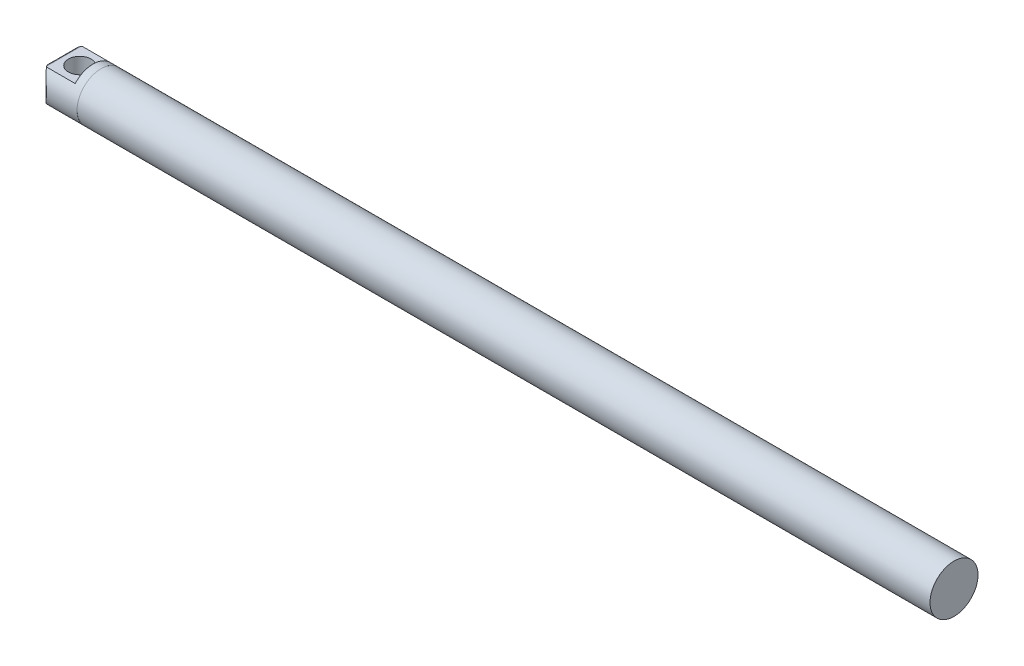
ISO-10303-21;
HEADER;
FILE_DESCRIPTION(('STEP AP214'),'2;1');
FILE_NAME('part.step','',(''),(''),'','','');
FILE_SCHEMA(('AUTOMOTIVE_DESIGN { 1 0 10303 214 1 1 1 1 }'));
ENDSEC;
DATA;
#1=APPLICATION_CONTEXT('core data for automotive mechanical design processes');
#2=APPLICATION_PROTOCOL_DEFINITION('international standard','automotive_design',2000,#1);
#3=PRODUCT_CONTEXT('',#1,'mechanical');
#4=PRODUCT('Part','Part','',(#3));
#5=PRODUCT_RELATED_PRODUCT_CATEGORY('part','',(#4));
#6=PRODUCT_DEFINITION_FORMATION('','',#4);
#7=PRODUCT_DEFINITION_CONTEXT('part definition',#1,'design');
#8=PRODUCT_DEFINITION('design','',#6,#7);
#9=PRODUCT_DEFINITION_SHAPE('','',#8);
#10=(LENGTH_UNIT() NAMED_UNIT(*) SI_UNIT(.MILLI.,.METRE.));
#11=(NAMED_UNIT(*) PLANE_ANGLE_UNIT() SI_UNIT($,.RADIAN.));
#12=(NAMED_UNIT(*) SI_UNIT($,.STERADIAN.) SOLID_ANGLE_UNIT());
#13=UNCERTAINTY_MEASURE_WITH_UNIT(LENGTH_MEASURE(1.E-05),#10,'distance_accuracy_value','');
#14=(GEOMETRIC_REPRESENTATION_CONTEXT(3) GLOBAL_UNCERTAINTY_ASSIGNED_CONTEXT((#13)) GLOBAL_UNIT_ASSIGNED_CONTEXT((#10,
#11,#12)) REPRESENTATION_CONTEXT('',''));
#15=CARTESIAN_POINT('',(0.,0.,0.));
#16=DIRECTION('',(0.,0.,1.));
#17=DIRECTION('',(1.,0.,0.));
#18=AXIS2_PLACEMENT_3D('',#15,#16,#17);
#19=CARTESIAN_POINT('',(6.87386354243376,-3.,0.));
#20=DIRECTION('',(0.,-1.,0.));
#21=DIRECTION('',(0.,0.,-1.));
#22=AXIS2_PLACEMENT_3D('',#19,#20,#21);
#23=PLANE('',#22);
#24=CARTESIAN_POINT('',(-4.,-3.,0.));
#25=DIRECTION('',(0.,-1.,0.));
#26=DIRECTION('',(0.,0.,-1.));
#27=AXIS2_PLACEMENT_3D('',#24,#25,#26);
#28=CIRCLE('',#27,2.125);
#29=CARTESIAN_POINT('',(-4.,-3.,-2.125));
#30=VERTEX_POINT('',#29);
#31=EDGE_CURVE('E137',#30,#30,#28,.T.);
#32=ORIENTED_EDGE('',*,*,#31,.F.);
#33=EDGE_LOOP('',(#32));
#34=FACE_BOUND('',#33,.T.);
#35=CARTESIAN_POINT('',(-2.375,-3.,0.));
#36=DIRECTION('',(0.,-1.,0.));
#37=DIRECTION('',(0.,0.,-1.));
#38=AXIS2_PLACEMENT_3D('',#35,#36,#37);
#39=CIRCLE('',#38,5.625);
#40=CARTESIAN_POINT('',(-7.,-3.,3.20156211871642));
#41=VERTEX_POINT('',#40);
#42=CARTESIAN_POINT('',(-6.89059796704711,-3.,3.35410196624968));
#43=VERTEX_POINT('',#42);
#44=EDGE_CURVE('E340',#41,#43,#39,.F.);
#45=ORIENTED_EDGE('',*,*,#44,.F.);
#46=CARTESIAN_POINT('',(-7.,-3.,-4.95));
#47=CARTESIAN_POINT('',(-7.,-3.,-1.65));
#48=CARTESIAN_POINT('',(-7.,-3.,1.65));
#49=CARTESIAN_POINT('',(-7.,-3.,4.95));
#50=(BOUNDED_CURVE() B_SPLINE_CURVE(3,(#46,#47,#48,#49),.UNSPECIFIED.,.F.,
.F.) B_SPLINE_CURVE_WITH_KNOTS((4,4),(-0.00495,0.00495),
.UNSPECIFIED.) CURVE() GEOMETRIC_REPRESENTATION_ITEM() RATIONAL_B_SPLINE_CURVE((1.,1.,1.,1.)) REPRESENTATION_ITEM(''));
#51=CARTESIAN_POINT('',(-7.,-3.,-3.20156211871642));
#52=VERTEX_POINT('',#51);
#53=EDGE_CURVE('E134',#41,#52,#50,.F.);
#54=ORIENTED_EDGE('',*,*,#53,.T.);
#55=CARTESIAN_POINT('',(-2.375,-3.,0.));
#56=DIRECTION('',(0.,-1.,0.));
#57=DIRECTION('',(0.,0.,-1.));
#58=AXIS2_PLACEMENT_3D('',#55,#56,#57);
#59=CIRCLE('',#58,5.625);
#60=CARTESIAN_POINT('',(-6.89059796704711,-3.,-3.35410196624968));
#61=VERTEX_POINT('',#60);
#62=EDGE_CURVE('E114',#61,#52,#59,.F.);
#63=ORIENTED_EDGE('',*,*,#62,.F.);
#64=DIRECTION('',(-1.,0.,0.));
#65=VECTOR('',#64,1.);
#66=CARTESIAN_POINT('',(6.87386354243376,-3.,-3.35410196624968));
#67=LINE('',#66,#65);
#68=CARTESIAN_POINT('',(-1.5,-3.,-3.35410196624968));
#69=VERTEX_POINT('',#68);
#70=EDGE_CURVE('E110',#69,#61,#67,.T.);
#71=ORIENTED_EDGE('',*,*,#70,.F.);
#72=DIRECTION('',(0.,0.,-1.));
#73=VECTOR('',#72,1.);
#74=CARTESIAN_POINT('',(-1.5,-3.,0.));
#75=LINE('',#74,#73);
#76=CARTESIAN_POINT('',(-1.5,-3.,3.35410196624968));
#77=VERTEX_POINT('',#76);
#78=EDGE_CURVE('E98',#77,#69,#75,.T.);
#79=ORIENTED_EDGE('',*,*,#78,.F.);
#80=DIRECTION('',(-1.,0.,0.));
#81=VECTOR('',#80,1.);
#82=CARTESIAN_POINT('',(6.87386354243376,-3.,3.35410196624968));
#83=LINE('',#82,#81);
#84=EDGE_CURVE('E106',#77,#43,#83,.T.);
#85=ORIENTED_EDGE('',*,*,#84,.T.);
#86=EDGE_LOOP('',(#45,#54,#63,#71,#79,#85));
#87=FACE_BOUND('',#86,.T.);
#88=ADVANCED_FACE('F56',(#34,#87),#23,.T.);
#89=CARTESIAN_POINT('',(6.87386354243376,3.,0.));
#90=DIRECTION('',(0.,-1.,0.));
#91=DIRECTION('',(0.,0.,-1.));
#92=AXIS2_PLACEMENT_3D('',#89,#90,#91);
#93=PLANE('',#92);
#94=CARTESIAN_POINT('',(-4.,3.,0.));
#95=DIRECTION('',(0.,-1.,0.));
#96=DIRECTION('',(0.,0.,-1.));
#97=AXIS2_PLACEMENT_3D('',#94,#95,#96);
#98=CIRCLE('',#97,2.125);
#99=CARTESIAN_POINT('',(-4.,3.,-2.125));
#100=VERTEX_POINT('',#99);
#101=EDGE_CURVE('E117',#100,#100,#98,.T.);
#102=ORIENTED_EDGE('',*,*,#101,.T.);
#103=EDGE_LOOP('',(#102));
#104=FACE_BOUND('',#103,.T.);
#105=CARTESIAN_POINT('',(-7.,3.,4.95));
#106=CARTESIAN_POINT('',(-7.,3.,1.65));
#107=CARTESIAN_POINT('',(-7.,3.,-1.65));
#108=CARTESIAN_POINT('',(-7.,3.,-4.95));
#109=(BOUNDED_CURVE() B_SPLINE_CURVE(3,(#105,#106,#107,#108),.UNSPECIFIED.,.F.,
.F.) B_SPLINE_CURVE_WITH_KNOTS((4,4),(-0.00495,0.00495),
.UNSPECIFIED.) CURVE() GEOMETRIC_REPRESENTATION_ITEM() RATIONAL_B_SPLINE_CURVE((1.,1.,1.,1.)) REPRESENTATION_ITEM(''));
#110=CARTESIAN_POINT('',(-7.,3.,-3.20156211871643));
#111=VERTEX_POINT('',#110);
#112=CARTESIAN_POINT('',(-7.,3.,3.20156211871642));
#113=VERTEX_POINT('',#112);
#114=EDGE_CURVE('E309',#111,#113,#109,.F.);
#115=ORIENTED_EDGE('',*,*,#114,.T.);
#116=CARTESIAN_POINT('',(-2.375,3.,0.));
#117=DIRECTION('',(0.,-1.,0.));
#118=DIRECTION('',(0.,0.,-1.));
#119=AXIS2_PLACEMENT_3D('',#116,#117,#118);
#120=CIRCLE('',#119,5.625);
#121=CARTESIAN_POINT('',(-6.89059796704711,3.,3.35410196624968));
#122=VERTEX_POINT('',#121);
#123=EDGE_CURVE('E77',#113,#122,#120,.F.);
#124=ORIENTED_EDGE('',*,*,#123,.T.);
#125=DIRECTION('',(-1.,0.,0.));
#126=VECTOR('',#125,1.);
#127=CARTESIAN_POINT('',(6.87386354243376,3.,3.35410196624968));
#128=LINE('',#127,#126);
#129=CARTESIAN_POINT('',(-1.5,3.,3.35410196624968));
#130=VERTEX_POINT('',#129);
#131=EDGE_CURVE('E125',#130,#122,#128,.T.);
#132=ORIENTED_EDGE('',*,*,#131,.F.);
#133=DIRECTION('',(0.,0.,-1.));
#134=VECTOR('',#133,1.);
#135=CARTESIAN_POINT('',(-1.5,3.,0.));
#136=LINE('',#135,#134);
#137=CARTESIAN_POINT('',(-1.5,3.,-3.35410196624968));
#138=VERTEX_POINT('',#137);
#139=EDGE_CURVE('E86',#130,#138,#136,.T.);
#140=ORIENTED_EDGE('',*,*,#139,.T.);
#141=DIRECTION('',(-1.,0.,0.));
#142=VECTOR('',#141,1.);
#143=CARTESIAN_POINT('',(6.87386354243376,3.,-3.35410196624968));
#144=LINE('',#143,#142);
#145=CARTESIAN_POINT('',(-6.89059796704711,3.,-3.35410196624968));
#146=VERTEX_POINT('',#145);
#147=EDGE_CURVE('E123',#138,#146,#144,.T.);
#148=ORIENTED_EDGE('',*,*,#147,.T.);
#149=CARTESIAN_POINT('',(-2.375,3.,0.));
#150=DIRECTION('',(0.,-1.,0.));
#151=DIRECTION('',(0.,0.,-1.));
#152=AXIS2_PLACEMENT_3D('',#149,#150,#151);
#153=CIRCLE('',#152,5.625);
#154=EDGE_CURVE('E278',#146,#111,#153,.F.);
#155=ORIENTED_EDGE('',*,*,#154,.T.);
#156=EDGE_LOOP('',(#115,#124,#132,#140,#148,#155));
#157=FACE_BOUND('',#156,.T.);
#158=ADVANCED_FACE('F158',(#104,#157),#93,.F.);
#159=CARTESIAN_POINT('',(-8.,0.,0.));
#160=DIRECTION('',(1.,0.,0.));
#161=DIRECTION('',(0.,0.,-1.));
#162=AXIS2_PLACEMENT_3D('',#159,#160,#161);
#163=CYLINDRICAL_SURFACE('',#162,4.5);
#164=ORIENTED_EDGE('',*,*,#131,.T.);
#165=CARTESIAN_POINT('',(-8.,4.5,0.));
#166=CARTESIAN_POINT('',(-8.0000261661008,4.50002487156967,0.108672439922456));
#167=CARTESIAN_POINT('',(-7.99685185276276,4.4960645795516,0.217328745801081));
#168=CARTESIAN_POINT('',(-7.98429829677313,4.48036197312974,0.43364470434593));
#169=CARTESIAN_POINT('',(-7.97492328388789,4.4686249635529,0.541304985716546));
#170=CARTESIAN_POINT('',(-7.95025630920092,4.43767275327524,0.754017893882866));
#171=CARTESIAN_POINT('',(-7.93500905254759,4.41851404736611,0.859083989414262));
#172=CARTESIAN_POINT('',(-7.8989397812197,4.37303995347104,1.0666829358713));
#173=CARTESIAN_POINT('',(-7.8781170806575,4.34672368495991,1.16921547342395));
#174=CARTESIAN_POINT('',(-7.83138654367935,4.28740740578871,1.37082003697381));
#175=CARTESIAN_POINT('',(-7.80549255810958,4.25442559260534,1.46990064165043));
#176=CARTESIAN_POINT('',(-7.74907704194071,4.18217468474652,1.66438967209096));
#177=CARTESIAN_POINT('',(-7.71855384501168,4.14290332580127,1.75979675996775));
#178=CARTESIAN_POINT('',(-7.62071427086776,4.01619280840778,2.04015550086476));
#179=CARTESIAN_POINT('',(-7.54717032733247,3.91991033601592,2.21906761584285));
#180=CARTESIAN_POINT('',(-7.41400776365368,3.74208663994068,2.50300782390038));
#181=CARTESIAN_POINT('',(-7.35765928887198,3.66596359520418,2.61311577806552));
#182=CARTESIAN_POINT('',(-7.24077925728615,3.50545479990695,2.82478438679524));
#183=CARTESIAN_POINT('',(-7.18024773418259,3.42106911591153,2.92634511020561));
#184=CARTESIAN_POINT('',(-7.05616873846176,3.24448393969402,3.12100163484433));
#185=CARTESIAN_POINT('',(-6.99261353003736,3.15226387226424,3.21407372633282));
#186=CARTESIAN_POINT('',(-6.86402643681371,2.9607052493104,3.39134893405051));
#187=CARTESIAN_POINT('',(-6.79899514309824,2.86136950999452,3.47555552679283));
#188=CARTESIAN_POINT('',(-6.66786388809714,2.65416610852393,3.63632686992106));
#189=CARTESIAN_POINT('',(-6.60176339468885,2.54618779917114,3.712748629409));
#190=CARTESIAN_POINT('',(-6.47126926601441,2.32314199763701,3.8562425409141));
#191=CARTESIAN_POINT('',(-6.4068761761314,2.2080722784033,3.92331173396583));
#192=CARTESIAN_POINT('',(-6.28212790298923,1.97107666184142,4.04755486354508));
#193=CARTESIAN_POINT('',(-6.22176202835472,1.84917063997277,4.10475569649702));
#194=CARTESIAN_POINT('',(-6.1076087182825,1.59819949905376,4.20882590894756));
#195=CARTESIAN_POINT('',(-6.0538156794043,1.46914061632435,4.25570411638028));
#196=CARTESIAN_POINT('',(-5.94878886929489,1.1837991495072,4.34443093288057));
#197=CARTESIAN_POINT('',(-5.89913843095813,1.02633016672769,4.3844814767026));
#198=CARTESIAN_POINT('',(-5.83904774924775,0.784290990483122,4.43188997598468));
#199=CARTESIAN_POINT('',(-5.82142186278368,0.702693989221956,4.44557676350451));
#200=CARTESIAN_POINT('',(-5.79163831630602,0.537908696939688,4.46850787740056));
#201=CARTESIAN_POINT('',(-5.77947792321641,0.454721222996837,4.47775442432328));
#202=CARTESIAN_POINT('',(-5.76109976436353,0.286524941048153,4.49166889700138));
#203=CARTESIAN_POINT('',(-5.75493766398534,0.201506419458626,4.49629394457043));
#204=CARTESIAN_POINT('',(-5.74906972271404,0.0311215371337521,4.50069912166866));
#205=CARTESIAN_POINT('',(-5.74936356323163,-0.0542448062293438,4.50047949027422));
#206=CARTESIAN_POINT('',(-5.75639368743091,-0.224602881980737,4.49519969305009));
#207=CARTESIAN_POINT('',(-5.76313338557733,-0.309594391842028,4.49013696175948));
#208=CARTESIAN_POINT('',(-5.78271599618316,-0.478484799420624,4.47529282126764));
#209=CARTESIAN_POINT('',(-5.79556215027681,-0.562383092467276,4.4655089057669));
#210=CARTESIAN_POINT('',(-5.82919455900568,-0.741434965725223,4.43955869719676));
#211=CARTESIAN_POINT('',(-5.85090630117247,-0.836304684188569,4.42263531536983));
#212=CARTESIAN_POINT('',(-5.90054851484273,-1.02323008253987,4.38316564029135));
#213=CARTESIAN_POINT('',(-5.92848362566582,-1.1152836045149,4.36061515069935));
#214=CARTESIAN_POINT('',(-6.01991290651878,-1.38707045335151,4.28502580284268));
#215=CARTESIAN_POINT('',(-6.09096633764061,-1.56212336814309,4.22409562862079));
#216=CARTESIAN_POINT('',(-6.22506502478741,-1.85603168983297,4.10166808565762));
#217=CARTESIAN_POINT('',(-6.28555954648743,-1.97786670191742,4.04424657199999));
#218=CARTESIAN_POINT('',(-6.41040539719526,-2.21449049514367,3.91968092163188));
#219=CARTESIAN_POINT('',(-6.4747585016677,-2.32927598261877,3.85253228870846));
#220=CARTESIAN_POINT('',(-6.60522718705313,-2.55192894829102,3.70880611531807));
#221=CARTESIAN_POINT('',(-6.67134479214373,-2.65978795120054,3.63221734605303));
#222=CARTESIAN_POINT('',(-6.80350788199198,-2.86837215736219,3.46985600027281));
#223=CARTESIAN_POINT('',(-6.86955337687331,-2.96909853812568,3.38408494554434));
#224=CARTESIAN_POINT('',(-7.00179089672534,-3.1657547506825,3.20101850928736));
#225=CARTESIAN_POINT('',(-7.06793973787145,-3.26148466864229,3.10347654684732));
#226=CARTESIAN_POINT('',(-7.19701960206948,-3.44462830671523,2.89886039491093));
#227=CARTESIAN_POINT('',(-7.25995013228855,-3.53204075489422,2.79178475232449));
#228=CARTESIAN_POINT('',(-7.38094837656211,-3.69757703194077,2.56849759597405));
#229=CARTESIAN_POINT('',(-7.43902625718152,-3.77572043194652,2.45230622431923));
#230=CARTESIAN_POINT('',(-7.54892283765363,-3.92188319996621,2.21105075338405));
#231=CARTESIAN_POINT('',(-7.60074450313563,-3.98990736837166,2.08599090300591));
#232=CARTESIAN_POINT('',(-7.71705925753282,-4.14128430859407,1.7724231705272));
#233=CARTESIAN_POINT('',(-7.77759057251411,-4.21888269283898,1.57952084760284));
#234=CARTESIAN_POINT('',(-7.85332276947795,-4.31529563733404,1.28032523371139));
#235=CARTESIAN_POINT('',(-7.87604793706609,-4.34409248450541,1.17900959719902));
#236=CARTESIAN_POINT('',(-7.91608660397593,-4.39468518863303,0.973608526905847));
#237=CARTESIAN_POINT('',(-7.93340176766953,-4.41648319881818,0.869523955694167));
#238=CARTESIAN_POINT('',(-7.96501040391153,-4.45620518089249,0.639056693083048));
#239=CARTESIAN_POINT('',(-7.97808537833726,-4.47258174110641,0.512229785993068));
#240=CARTESIAN_POINT('',(-7.99120914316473,-4.48900761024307,0.320825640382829));
#241=CARTESIAN_POINT('',(-7.99450231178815,-4.49312643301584,0.256780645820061));
#242=CARTESIAN_POINT('',(-7.99889853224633,-4.49862325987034,0.128495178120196));
#243=CARTESIAN_POINT('',(-8.00000147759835,-4.50000113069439,0.0642546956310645));
#244=CARTESIAN_POINT('',(-8.,-4.5,0.));
#245=B_SPLINE_CURVE_WITH_KNOTS('',3,(#165,#166,#167,#168,#169,#170,#171,#172,#173,#174,#175,
#176,#177,#178,#179,#180,#181,#182,#183,#184,#185,#186,#187,#188,#189,#190,#191,#192,#193,#194,
#195,#196,#197,#198,#199,#200,#201,#202,#203,#204,#205,#206,#207,#208,#209,#210,#211,#212,#213,
#214,#215,#216,#217,#218,#219,#220,#221,#222,#223,#224,#225,#226,#227,#228,#229,#230,#231,#232,
#233,#234,#235,#236,#237,#238,#239,#240,#241,#242,#243,#244),.UNSPECIFIED.,.F.,.F.,(4,2,2,2,2,2,
2,2,2,2,2,2,2,2,2,2,2,2,2,2,2,2,2,2,2,2,2,2,2,2,2,2,2,2,2,2,2,2,2,4),(0.,0.325873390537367,
0.651524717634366,0.974744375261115,1.2980038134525,1.6203923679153,1.94289724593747,
2.58846980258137,3.02370253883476,3.45893176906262,3.89534162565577,4.33157970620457,
4.77476231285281,5.21808481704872,5.66017926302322,6.10189414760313,6.60960830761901,
6.86313355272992,7.11653187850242,7.37225998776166,7.62797547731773,7.88382649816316,
8.13981349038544,8.4356990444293,8.73180591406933,9.32495860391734,9.7674351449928,
10.2101168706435,10.6533303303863,11.0964704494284,11.5514441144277,12.0064872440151,
12.4605517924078,12.9144002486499,13.560943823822,13.8838717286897,14.2067001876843,
14.5915126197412,14.7842151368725,14.97692702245),.UNSPECIFIED.);
#246=EDGE_CURVE('E339',#122,#43,#245,.T.);
#247=ORIENTED_EDGE('',*,*,#246,.T.);
#248=ORIENTED_EDGE('',*,*,#84,.F.);
#249=CARTESIAN_POINT('',(-1.5,0.,0.));
#250=DIRECTION('',(-1.,0.,0.));
#251=DIRECTION('',(0.,0.,1.));
#252=AXIS2_PLACEMENT_3D('',#249,#250,#251);
#253=CIRCLE('',#252,4.5);
#254=EDGE_CURVE('E102',#77,#69,#253,.F.);
#255=ORIENTED_EDGE('',*,*,#254,.T.);
#256=ORIENTED_EDGE('',*,*,#70,.T.);
#257=CARTESIAN_POINT('',(-8.,-4.5,0.));
#258=CARTESIAN_POINT('',(-8.0000261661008,-4.50002487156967,-0.108672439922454));
#259=CARTESIAN_POINT('',(-7.99685185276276,-4.4960645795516,-0.217328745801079));
#260=CARTESIAN_POINT('',(-7.98429829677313,-4.48036197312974,-0.433644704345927));
#261=CARTESIAN_POINT('',(-7.97492328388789,-4.4686249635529,-0.541304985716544));
#262=CARTESIAN_POINT('',(-7.95025630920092,-4.43767275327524,-0.754017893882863));
#263=CARTESIAN_POINT('',(-7.93500905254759,-4.41851404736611,-0.859083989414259));
#264=CARTESIAN_POINT('',(-7.8989397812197,-4.37303995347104,-1.06668293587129));
#265=CARTESIAN_POINT('',(-7.8781170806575,-4.34672368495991,-1.16921547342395));
#266=CARTESIAN_POINT('',(-7.83138654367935,-4.28740740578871,-1.3708200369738));
#267=CARTESIAN_POINT('',(-7.80549255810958,-4.25442559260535,-1.46990064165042));
#268=CARTESIAN_POINT('',(-7.74907704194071,-4.18217468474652,-1.66438967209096));
#269=CARTESIAN_POINT('',(-7.71855384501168,-4.14290332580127,-1.75979675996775));
#270=CARTESIAN_POINT('',(-7.62071427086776,-4.01619280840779,-2.04015550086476));
#271=CARTESIAN_POINT('',(-7.54717032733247,-3.91991033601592,-2.21906761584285));
#272=CARTESIAN_POINT('',(-7.41400776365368,-3.74208663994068,-2.50300782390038));
#273=CARTESIAN_POINT('',(-7.35765928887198,-3.66596359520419,-2.61311577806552));
#274=CARTESIAN_POINT('',(-7.24077925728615,-3.50545479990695,-2.82478438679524));
#275=CARTESIAN_POINT('',(-7.18024773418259,-3.42106911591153,-2.92634511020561));
#276=CARTESIAN_POINT('',(-7.05616873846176,-3.24448393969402,-3.12100163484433));
#277=CARTESIAN_POINT('',(-6.99261353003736,-3.15226387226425,-3.21407372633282));
#278=CARTESIAN_POINT('',(-6.86402643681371,-2.9607052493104,-3.3913489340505));
#279=CARTESIAN_POINT('',(-6.79899514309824,-2.86136950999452,-3.47555552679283));
#280=CARTESIAN_POINT('',(-6.66786388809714,-2.65416610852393,-3.63632686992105));
#281=CARTESIAN_POINT('',(-6.60176339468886,-2.54618779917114,-3.712748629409));
#282=CARTESIAN_POINT('',(-6.47126926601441,-2.32314199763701,-3.8562425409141));
#283=CARTESIAN_POINT('',(-6.4068761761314,-2.2080722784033,-3.92331173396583));
#284=CARTESIAN_POINT('',(-6.28212790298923,-1.97107666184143,-4.04755486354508));
#285=CARTESIAN_POINT('',(-6.22176202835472,-1.84917063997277,-4.10475569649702));
#286=CARTESIAN_POINT('',(-6.1076087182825,-1.59819949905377,-4.20882590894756));
#287=CARTESIAN_POINT('',(-6.05381567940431,-1.46914061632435,-4.25570411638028));
#288=CARTESIAN_POINT('',(-5.94878886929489,-1.1837991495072,-4.34443093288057));
#289=CARTESIAN_POINT('',(-5.89913843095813,-1.02633016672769,-4.3844814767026));
#290=CARTESIAN_POINT('',(-5.83904774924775,-0.784290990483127,-4.43188997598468));
#291=CARTESIAN_POINT('',(-5.82142186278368,-0.70269398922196,-4.44557676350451));
#292=CARTESIAN_POINT('',(-5.79163831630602,-0.537908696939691,-4.46850787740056));
#293=CARTESIAN_POINT('',(-5.77947792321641,-0.45472122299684,-4.47775442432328));
#294=CARTESIAN_POINT('',(-5.76109976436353,-0.286524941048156,-4.49166889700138));
#295=CARTESIAN_POINT('',(-5.75493766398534,-0.201506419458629,-4.49629394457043));
#296=CARTESIAN_POINT('',(-5.74906972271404,-0.0311215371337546,-4.50069912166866));
#297=CARTESIAN_POINT('',(-5.74936356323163,0.0542448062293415,-4.50047949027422));
#298=CARTESIAN_POINT('',(-5.75639368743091,0.224602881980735,-4.49519969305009));
#299=CARTESIAN_POINT('',(-5.76313338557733,0.309594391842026,-4.49013696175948));
#300=CARTESIAN_POINT('',(-5.78271599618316,0.478484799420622,-4.47529282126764));
#301=CARTESIAN_POINT('',(-5.79556215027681,0.562383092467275,-4.4655089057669));
#302=CARTESIAN_POINT('',(-5.82919455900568,0.741434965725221,-4.43955869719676));
#303=CARTESIAN_POINT('',(-5.85090630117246,0.836304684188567,-4.42263531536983));
#304=CARTESIAN_POINT('',(-5.90054851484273,1.02323008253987,-4.38316564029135));
#305=CARTESIAN_POINT('',(-5.92848362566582,1.1152836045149,-4.36061515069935));
#306=CARTESIAN_POINT('',(-6.01991290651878,1.38707045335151,-4.28502580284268));
#307=CARTESIAN_POINT('',(-6.09096633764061,1.56212336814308,-4.22409562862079));
#308=CARTESIAN_POINT('',(-6.22506502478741,1.85603168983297,-4.10166808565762));
#309=CARTESIAN_POINT('',(-6.28555954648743,1.97786670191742,-4.044246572));
#310=CARTESIAN_POINT('',(-6.41040539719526,2.21449049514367,-3.91968092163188));
#311=CARTESIAN_POINT('',(-6.4747585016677,2.32927598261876,-3.85253228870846));
#312=CARTESIAN_POINT('',(-6.60522718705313,2.55192894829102,-3.70880611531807));
#313=CARTESIAN_POINT('',(-6.67134479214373,2.65978795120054,-3.63221734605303));
#314=CARTESIAN_POINT('',(-6.80350788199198,2.86837215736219,-3.46985600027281));
#315=CARTESIAN_POINT('',(-6.86955337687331,2.96909853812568,-3.38408494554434));
#316=CARTESIAN_POINT('',(-7.00179089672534,3.16575475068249,-3.20101850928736));
#317=CARTESIAN_POINT('',(-7.06793973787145,3.26148466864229,-3.10347654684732));
#318=CARTESIAN_POINT('',(-7.19701960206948,3.44462830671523,-2.89886039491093));
#319=CARTESIAN_POINT('',(-7.25995013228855,3.53204075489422,-2.79178475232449));
#320=CARTESIAN_POINT('',(-7.38094837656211,3.69757703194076,-2.56849759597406));
#321=CARTESIAN_POINT('',(-7.43902625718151,3.77572043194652,-2.45230622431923));
#322=CARTESIAN_POINT('',(-7.54892283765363,3.9218831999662,-2.21105075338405));
#323=CARTESIAN_POINT('',(-7.60074450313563,3.98990736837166,-2.08599090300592));
#324=CARTESIAN_POINT('',(-7.71705925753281,4.14128430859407,-1.7724231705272));
#325=CARTESIAN_POINT('',(-7.7775905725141,4.21888269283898,-1.57952084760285));
#326=CARTESIAN_POINT('',(-7.85332276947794,4.31529563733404,-1.2803252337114));
#327=CARTESIAN_POINT('',(-7.87604793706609,4.34409248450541,-1.17900959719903));
#328=CARTESIAN_POINT('',(-7.91608660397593,4.39468518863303,-0.973608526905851));
#329=CARTESIAN_POINT('',(-7.93340176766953,4.41648319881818,-0.869523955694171));
#330=CARTESIAN_POINT('',(-7.96501040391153,4.45620518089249,-0.639056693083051));
#331=CARTESIAN_POINT('',(-7.97808537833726,4.47258174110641,-0.51222978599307));
#332=CARTESIAN_POINT('',(-7.99120914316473,4.48900761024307,-0.32082564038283));
#333=CARTESIAN_POINT('',(-7.99450231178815,4.49312643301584,-0.256780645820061));
#334=CARTESIAN_POINT('',(-7.99889853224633,4.49862325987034,-0.128495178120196));
#335=CARTESIAN_POINT('',(-8.00000147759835,4.50000113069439,-0.0642546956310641));
#336=CARTESIAN_POINT('',(-8.,4.5,0.));
#337=B_SPLINE_CURVE_WITH_KNOTS('',3,(#257,#258,#259,#260,#261,#262,#263,#264,#265,#266,#267,
#268,#269,#270,#271,#272,#273,#274,#275,#276,#277,#278,#279,#280,#281,#282,#283,#284,#285,#286,
#287,#288,#289,#290,#291,#292,#293,#294,#295,#296,#297,#298,#299,#300,#301,#302,#303,#304,#305,
#306,#307,#308,#309,#310,#311,#312,#313,#314,#315,#316,#317,#318,#319,#320,#321,#322,#323,#324,
#325,#326,#327,#328,#329,#330,#331,#332,#333,#334,#335,#336),.UNSPECIFIED.,.F.,.F.,(4,2,2,2,2,2,
2,2,2,2,2,2,2,2,2,2,2,2,2,2,2,2,2,2,2,2,2,2,2,2,2,2,2,2,2,2,2,2,2,4),(0.,0.325873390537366,
0.651524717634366,0.974744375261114,1.2980038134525,1.6203923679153,1.94289724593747,
2.58846980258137,3.02370253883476,3.45893176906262,3.89534162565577,4.33157970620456,
4.77476231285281,5.21808481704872,5.66017926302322,6.10189414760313,6.60960830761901,
6.86313355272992,7.11653187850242,7.37225998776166,7.62797547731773,7.88382649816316,
8.13981349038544,8.4356990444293,8.73180591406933,9.32495860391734,9.7674351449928,
10.2101168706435,10.6533303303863,11.0964704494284,11.5514441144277,12.0064872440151,
12.4605517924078,12.9144002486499,13.560943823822,13.8838717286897,14.2067001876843,
14.5915126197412,14.7842151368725,14.97692702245),.UNSPECIFIED.);
#338=EDGE_CURVE('E284',#61,#146,#337,.T.);
#339=ORIENTED_EDGE('',*,*,#338,.T.);
#340=ORIENTED_EDGE('',*,*,#147,.F.);
#341=CARTESIAN_POINT('',(-1.5,0.,0.));
#342=DIRECTION('',(-1.,0.,0.));
#343=DIRECTION('',(0.,0.,1.));
#344=AXIS2_PLACEMENT_3D('',#341,#342,#343);
#345=CIRCLE('',#344,4.5);
#346=EDGE_CURVE('E142',#138,#130,#345,.F.);
#347=ORIENTED_EDGE('',*,*,#346,.T.);
#348=EDGE_LOOP('',(#164,#247,#248,#255,#256,#339,#340,#347));
#349=FACE_BOUND('',#348,.T.);
#350=CARTESIAN_POINT('',(0.,0.,0.));
#351=DIRECTION('',(-1.,0.,0.));
#352=DIRECTION('',(0.,0.,1.));
#353=AXIS2_PLACEMENT_3D('',#350,#351,#352);
#354=CIRCLE('',#353,4.5);
#355=CARTESIAN_POINT('',(0.,0.,4.5));
#356=VERTEX_POINT('',#355);
#357=EDGE_CURVE('E131',#356,#356,#354,.T.);
#358=ORIENTED_EDGE('',*,*,#357,.T.);
#359=EDGE_LOOP('',(#358));
#360=FACE_BOUND('',#359,.T.);
#361=ADVANCED_FACE('F120',(#349,#360),#163,.T.);
#362=CARTESIAN_POINT('',(0.,0.,0.));
#363=DIRECTION('',(-1.,0.,0.));
#364=DIRECTION('',(0.,0.,1.));
#365=AXIS2_PLACEMENT_3D('',#362,#363,#364);
#366=PLANE('',#365);
#367=ORIENTED_EDGE('',*,*,#357,.F.);
#368=EDGE_LOOP('',(#367));
#369=FACE_BOUND('',#368,.T.);
#370=ADVANCED_FACE('F173',(#369),#366,.F.);
#371=CARTESIAN_POINT('',(-1.5,0.,0.));
#372=DIRECTION('',(-1.,0.,0.));
#373=DIRECTION('',(0.,0.,1.));
#374=AXIS2_PLACEMENT_3D('',#371,#372,#373);
#375=PLANE('',#374);
#376=ORIENTED_EDGE('',*,*,#254,.F.);
#377=ORIENTED_EDGE('',*,*,#78,.T.);
#378=EDGE_LOOP('',(#376,#377));
#379=FACE_BOUND('',#378,.T.);
#380=ADVANCED_FACE('F100',(#379),#375,.T.);
#381=CARTESIAN_POINT('',(-1.5,0.,0.));
#382=DIRECTION('',(-1.,0.,0.));
#383=DIRECTION('',(0.,0.,1.));
#384=AXIS2_PLACEMENT_3D('',#381,#382,#383);
#385=PLANE('',#384);
#386=ORIENTED_EDGE('',*,*,#346,.F.);
#387=ORIENTED_EDGE('',*,*,#139,.F.);
#388=EDGE_LOOP('',(#386,#387));
#389=FACE_BOUND('',#388,.T.);
#390=ADVANCED_FACE('F169',(#389),#385,.T.);
#391=CARTESIAN_POINT('',(-4.,4.5,0.));
#392=DIRECTION('',(0.,-1.,0.));
#393=DIRECTION('',(0.,0.,-1.));
#394=AXIS2_PLACEMENT_3D('',#391,#392,#393);
#395=CYLINDRICAL_SURFACE('',#394,2.125);
#396=ORIENTED_EDGE('',*,*,#31,.T.);
#397=EDGE_LOOP('',(#396));
#398=FACE_BOUND('',#397,.T.);
#399=ORIENTED_EDGE('',*,*,#101,.F.);
#400=EDGE_LOOP('',(#399));
#401=FACE_BOUND('',#400,.T.);
#402=ADVANCED_FACE('F222',(#398,#401),#395,.F.);
#403=CARTESIAN_POINT('',(-8.,0.,-4.95));
#404=CARTESIAN_POINT('',(-8.,0.,-1.65));
#405=CARTESIAN_POINT('',(-8.,0.,1.65));
#406=CARTESIAN_POINT('',(-8.,0.,4.95));
#407=CARTESIAN_POINT('',(-8.,-3.,-4.95));
#408=CARTESIAN_POINT('',(-8.,-3.,-1.65));
#409=CARTESIAN_POINT('',(-8.,-3.,1.65));
#410=CARTESIAN_POINT('',(-8.,-3.,4.95));
#411=CARTESIAN_POINT('',(-7.,-3.,-4.95));
#412=CARTESIAN_POINT('',(-7.,-3.,-1.65));
#413=CARTESIAN_POINT('',(-7.,-3.,1.65));
#414=CARTESIAN_POINT('',(-7.,-3.,4.95));
#415=(BOUNDED_SURFACE() B_SPLINE_SURFACE(2,3,((#403,#404,#405,#406),(#407,#408,#409,#410),(#411,
#412,#413,#414)),.UNSPECIFIED.,.F.,.F.,.F.) B_SPLINE_SURFACE_WITH_KNOTS((3,3),(4,4),(0.,1.),
(-0.00495,0.00495),
.UNSPECIFIED.) GEOMETRIC_REPRESENTATION_ITEM() RATIONAL_B_SPLINE_SURFACE(((1.,1.,1.,1.),
(0.707106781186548,0.707106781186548,0.707106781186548,0.707106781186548),(1.,1.,1.,1.))) REPRESENTATION_ITEM('') SURFACE());
#416=CARTESIAN_POINT('',(-7.,-3.,3.20156211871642));
#417=CARTESIAN_POINT('',(-7.03236832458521,-3.00001999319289,3.15483054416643));
#418=CARTESIAN_POINT('',(-7.06386874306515,-2.99529017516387,3.10778414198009));
#419=CARTESIAN_POINT('',(-7.12447778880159,-2.97804493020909,3.01431650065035));
#420=CARTESIAN_POINT('',(-7.15360963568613,-2.96561909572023,2.96789426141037));
#421=CARTESIAN_POINT('',(-7.20655169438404,-2.93629868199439,2.88080890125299));
#422=CARTESIAN_POINT('',(-7.23059667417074,-2.92003294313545,2.84006603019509));
#423=CARTESIAN_POINT('',(-7.27692880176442,-2.88356602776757,2.75932648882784));
#424=CARTESIAN_POINT('',(-7.29921481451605,-2.86336233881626,2.71933031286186));
#425=CARTESIAN_POINT('',(-7.34227317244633,-2.81963324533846,2.63986417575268));
#426=CARTESIAN_POINT('',(-7.36303203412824,-2.796082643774,2.60040095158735));
#427=CARTESIAN_POINT('',(-7.40296351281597,-2.74641294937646,2.52232617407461));
#428=CARTESIAN_POINT('',(-7.42213647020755,-2.72029441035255,2.48371443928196));
#429=CARTESIAN_POINT('',(-7.46491269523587,-2.65731510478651,2.39510899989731));
#430=CARTESIAN_POINT('',(-7.48798180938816,-2.61968265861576,2.34540743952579));
#431=CARTESIAN_POINT('',(-7.53188468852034,-2.54160118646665,2.24723255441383));
#432=CARTESIAN_POINT('',(-7.55271746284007,-2.50115092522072,2.19875978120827));
#433=CARTESIAN_POINT('',(-7.61228117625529,-2.3763879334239,2.05483114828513));
#434=CARTESIAN_POINT('',(-7.64801228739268,-2.28876468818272,1.96100210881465));
#435=CARTESIAN_POINT('',(-7.71298681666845,-2.10772627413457,1.77653691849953));
#436=CARTESIAN_POINT('',(-7.74221846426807,-2.01430098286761,1.68590680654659));
#437=CARTESIAN_POINT('',(-7.79510118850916,-1.82364568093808,1.50724754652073));
#438=CARTESIAN_POINT('',(-7.81875686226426,-1.72641888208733,1.41921630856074));
#439=CARTESIAN_POINT('',(-7.8586546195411,-1.54112138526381,1.25553524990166));
#440=CARTESIAN_POINT('',(-7.87544620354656,-1.45335622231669,1.17966990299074));
#441=CARTESIAN_POINT('',(-7.90559961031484,-1.27627420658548,1.02906916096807));
#442=CARTESIAN_POINT('',(-7.91896106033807,-1.18695718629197,0.95433388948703));
#443=CARTESIAN_POINT('',(-7.95422577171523,-0.917770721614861,0.731749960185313));
#444=CARTESIAN_POINT('',(-7.97139902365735,-0.73623224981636,0.585147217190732));
#445=CARTESIAN_POINT('',(-7.98841602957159,-0.464263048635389,0.367830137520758));
#446=CARTESIAN_POINT('',(-7.99263114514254,-0.374543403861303,0.296511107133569));
#447=CARTESIAN_POINT('',(-7.99834286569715,-0.194844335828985,0.154047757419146));
#448=CARTESIAN_POINT('',(-7.99983900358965,-0.10486487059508,0.0829034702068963));
#449=CARTESIAN_POINT('',(-7.99999589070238,-0.00992276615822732,0.00784463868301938));
#450=CARTESIAN_POINT('',(-7.99999999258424,-0.00496137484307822,0.00392231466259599));
#451=CARTESIAN_POINT('',(-8.,0.,0.));
#452=B_SPLINE_CURVE_WITH_KNOTS('',3,(#416,#417,#418,#419,#420,#421,#422,#423,#424,#425,#426,
#427,#428,#429,#430,#431,#432,#433,#434,#435,#436,#437,#438,#439,#440,#441,#442,#443,#444,#445,
#446,#447,#448,#449,#450,#451),.UNSPECIFIED.,.F.,.F.,(4,2,2,2,2,2,2,2,2,2,2,2,2,2,2,2,2,4),(0.,
0.169998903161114,0.33805504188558,0.487931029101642,0.637902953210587,0.789070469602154,
0.940205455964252,1.13948197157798,1.33884640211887,1.73812101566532,2.13811293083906,
2.53777390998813,2.88935738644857,3.24097905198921,3.94248262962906,4.28653380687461,
4.63064408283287,4.64961775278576),.UNSPECIFIED.);
#453=CARTESIAN_POINT('',(-8.,0.,0.));
#454=VERTEX_POINT('',#453);
#455=EDGE_CURVE('E212',#454,#41,#452,.F.);
#456=CARTESIAN_POINT('',(-7.,-3.,-3.20156211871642));
#457=CARTESIAN_POINT('',(-7.03236832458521,-3.00001999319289,-3.15483054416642));
#458=CARTESIAN_POINT('',(-7.06386874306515,-2.99529017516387,-3.10778414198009));
#459=CARTESIAN_POINT('',(-7.12447778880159,-2.97804493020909,-3.01431650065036));
#460=CARTESIAN_POINT('',(-7.15360963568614,-2.96561909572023,-2.96789426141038));
#461=CARTESIAN_POINT('',(-7.20655169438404,-2.93629868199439,-2.880808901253));
#462=CARTESIAN_POINT('',(-7.23059667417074,-2.92003294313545,-2.84006603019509));
#463=CARTESIAN_POINT('',(-7.27692880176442,-2.88356602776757,-2.75932648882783));
#464=CARTESIAN_POINT('',(-7.29921481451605,-2.86336233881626,-2.71933031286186));
#465=CARTESIAN_POINT('',(-7.34227317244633,-2.81963324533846,-2.63986417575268));
#466=CARTESIAN_POINT('',(-7.36303203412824,-2.796082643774,-2.60040095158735));
#467=CARTESIAN_POINT('',(-7.40296351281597,-2.74641294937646,-2.5223261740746));
#468=CARTESIAN_POINT('',(-7.42213647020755,-2.72029441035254,-2.48371443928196));
#469=CARTESIAN_POINT('',(-7.46491269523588,-2.65731510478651,-2.3951089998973));
#470=CARTESIAN_POINT('',(-7.48798180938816,-2.61968265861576,-2.34540743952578));
#471=CARTESIAN_POINT('',(-7.53188468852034,-2.54160118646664,-2.24723255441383));
#472=CARTESIAN_POINT('',(-7.55271746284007,-2.50115092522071,-2.19875978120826));
#473=CARTESIAN_POINT('',(-7.61228117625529,-2.37638793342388,-2.05483114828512));
#474=CARTESIAN_POINT('',(-7.64801228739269,-2.28876468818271,-1.96100210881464));
#475=CARTESIAN_POINT('',(-7.71298681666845,-2.10772627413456,-1.77653691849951));
#476=CARTESIAN_POINT('',(-7.74221846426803,-2.0143009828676,-1.68590680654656));
#477=CARTESIAN_POINT('',(-7.7951011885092,-1.82364568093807,-1.50724754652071));
#478=CARTESIAN_POINT('',(-7.8187568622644,-1.72641888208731,-1.41921630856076));
#479=CARTESIAN_POINT('',(-7.85865461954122,-1.5411213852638,-1.25553524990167));
#480=CARTESIAN_POINT('',(-7.8754462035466,-1.45335622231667,-1.17966990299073));
#481=CARTESIAN_POINT('',(-7.90559961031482,-1.27627420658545,-1.02906916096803));
#482=CARTESIAN_POINT('',(-7.91896106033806,-1.18695718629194,-0.954333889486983));
#483=CARTESIAN_POINT('',(-7.95422577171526,-0.917770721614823,-0.731749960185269));
#484=CARTESIAN_POINT('',(-7.97139902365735,-0.736232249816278,-0.58514721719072));
#485=CARTESIAN_POINT('',(-7.98841602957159,-0.464263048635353,-0.36783013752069));
#486=CARTESIAN_POINT('',(-7.99263114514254,-0.374543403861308,-0.296511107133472));
#487=CARTESIAN_POINT('',(-7.99834286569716,-0.194844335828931,-0.154047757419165));
#488=CARTESIAN_POINT('',(-7.99983900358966,-0.104864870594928,-0.0829034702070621));
#489=CARTESIAN_POINT('',(-7.99999589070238,-0.0099227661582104,-0.00784463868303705));
#490=CARTESIAN_POINT('',(-7.99999999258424,-0.00496137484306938,-0.00392231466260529));
#491=CARTESIAN_POINT('',(-8.,0.,0.));
#492=B_SPLINE_CURVE_WITH_KNOTS('',3,(#456,#457,#458,#459,#460,#461,#462,#463,#464,#465,#466,
#467,#468,#469,#470,#471,#472,#473,#474,#475,#476,#477,#478,#479,#480,#481,#482,#483,#484,#485,
#486,#487,#488,#489,#490,#491),.UNSPECIFIED.,.F.,.F.,(4,2,2,2,2,2,2,2,2,2,2,2,2,2,2,2,2,4),(0.,
0.169998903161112,0.33805504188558,0.487931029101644,0.637902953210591,0.789070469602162,
0.940205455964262,1.13948197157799,1.33884640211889,1.73812101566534,2.13811293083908,
2.53777390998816,2.88935738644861,3.24097905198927,3.94248262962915,4.28653380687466,
4.63064408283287,4.64961775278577),.UNSPECIFIED.);
#493=EDGE_CURVE('E277',#52,#454,#492,.T.);
#494=ORIENTED_EDGE('',*,*,#455,.F.);
#495=ORIENTED_EDGE('',*,*,#493,.F.);
#496=ORIENTED_EDGE('',*,*,#53,.F.);
#497=EDGE_LOOP('',(#494,#495,#496));
#498=FACE_BOUND('',#497,.T.);
#499=ADVANCED_FACE('F215',(#498),#415,.T.);
#500=CARTESIAN_POINT('',(-8.,0.,4.95));
#501=CARTESIAN_POINT('',(-8.,0.,1.65));
#502=CARTESIAN_POINT('',(-8.,0.,-1.65));
#503=CARTESIAN_POINT('',(-8.,0.,-4.95));
#504=CARTESIAN_POINT('',(-8.,3.,4.95));
#505=CARTESIAN_POINT('',(-8.,3.,1.65));
#506=CARTESIAN_POINT('',(-8.,3.,-1.65));
#507=CARTESIAN_POINT('',(-8.,3.,-4.95));
#508=CARTESIAN_POINT('',(-7.,3.,4.95));
#509=CARTESIAN_POINT('',(-7.,3.,1.65));
#510=CARTESIAN_POINT('',(-7.,3.,-1.65));
#511=CARTESIAN_POINT('',(-7.,3.,-4.95));
#512=(BOUNDED_SURFACE() B_SPLINE_SURFACE(2,3,((#500,#501,#502,#503),(#504,#505,#506,#507),(#508,
#509,#510,#511)),.UNSPECIFIED.,.F.,.F.,.F.) B_SPLINE_SURFACE_WITH_KNOTS((3,3),(4,4),(0.,1.),
(-0.00495,0.00495),
.UNSPECIFIED.) GEOMETRIC_REPRESENTATION_ITEM() RATIONAL_B_SPLINE_SURFACE(((1.,1.,1.,1.),
(0.707106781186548,0.707106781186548,0.707106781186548,0.707106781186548),(1.,1.,1.,1.))) REPRESENTATION_ITEM('') SURFACE());
#513=CARTESIAN_POINT('',(-7.,3.,3.20156211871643));
#514=CARTESIAN_POINT('',(-7.0323683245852,3.0000199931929,3.15483054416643));
#515=CARTESIAN_POINT('',(-7.06386874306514,2.99529017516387,3.1077841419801));
#516=CARTESIAN_POINT('',(-7.12447778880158,2.97804493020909,3.01431650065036));
#517=CARTESIAN_POINT('',(-7.15360963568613,2.96561909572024,2.96789426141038));
#518=CARTESIAN_POINT('',(-7.20655169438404,2.93629868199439,2.880808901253));
#519=CARTESIAN_POINT('',(-7.23059667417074,2.92003294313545,2.84006603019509));
#520=CARTESIAN_POINT('',(-7.27692880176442,2.88356602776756,2.75932648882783));
#521=CARTESIAN_POINT('',(-7.29921481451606,2.86336233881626,2.71933031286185));
#522=CARTESIAN_POINT('',(-7.34227317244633,2.81963324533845,2.63986417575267));
#523=CARTESIAN_POINT('',(-7.36303203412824,2.79608264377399,2.60040095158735));
#524=CARTESIAN_POINT('',(-7.40296351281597,2.74641294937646,2.52232617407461));
#525=CARTESIAN_POINT('',(-7.42213647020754,2.72029441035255,2.48371443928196));
#526=CARTESIAN_POINT('',(-7.46491269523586,2.65731510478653,2.39510899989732));
#527=CARTESIAN_POINT('',(-7.48798180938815,2.61968265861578,2.3454074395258));
#528=CARTESIAN_POINT('',(-7.53188468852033,2.54160118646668,2.24723255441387));
#529=CARTESIAN_POINT('',(-7.55271746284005,2.50115092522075,2.19875978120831));
#530=CARTESIAN_POINT('',(-7.61228117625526,2.37638793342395,2.05483114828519));
#531=CARTESIAN_POINT('',(-7.64801228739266,2.28876468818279,1.96100210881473));
#532=CARTESIAN_POINT('',(-7.71298681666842,2.10772627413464,1.77653691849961));
#533=CARTESIAN_POINT('',(-7.74221846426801,2.01430098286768,1.68590680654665));
#534=CARTESIAN_POINT('',(-7.79510118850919,1.82364568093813,1.50724754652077));
#535=CARTESIAN_POINT('',(-7.81875686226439,1.72641888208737,1.4192163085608));
#536=CARTESIAN_POINT('',(-7.85865461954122,1.54112138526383,1.25553524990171));
#537=CARTESIAN_POINT('',(-7.87544620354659,1.45335622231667,1.17966990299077));
#538=CARTESIAN_POINT('',(-7.90559961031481,1.27627420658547,1.02906916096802));
#539=CARTESIAN_POINT('',(-7.91896106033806,1.18695718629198,0.954333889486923));
#540=CARTESIAN_POINT('',(-7.95422577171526,0.917770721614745,0.731749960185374));
#541=CARTESIAN_POINT('',(-7.97139902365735,0.736232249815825,0.58514721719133));
#542=CARTESIAN_POINT('',(-7.98841602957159,0.464263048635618,0.367830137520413));
#543=CARTESIAN_POINT('',(-7.99263114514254,0.374543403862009,0.296511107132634));
#544=CARTESIAN_POINT('',(-7.99834286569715,0.19484433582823,0.154047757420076));
#545=CARTESIAN_POINT('',(-7.99983900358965,0.104864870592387,0.0829034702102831));
#546=CARTESIAN_POINT('',(-7.99999589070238,0.00992276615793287,0.00784463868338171));
#547=CARTESIAN_POINT('',(-7.99999999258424,0.00496137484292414,0.00392231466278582));
#548=CARTESIAN_POINT('',(-8.,0.,0.));
#549=B_SPLINE_CURVE_WITH_KNOTS('',3,(#513,#514,#515,#516,#517,#518,#519,#520,#521,#522,#523,
#524,#525,#526,#527,#528,#529,#530,#531,#532,#533,#534,#535,#536,#537,#538,#539,#540,#541,#542,
#543,#544,#545,#546,#547,#548),.UNSPECIFIED.,.F.,.F.,(4,2,2,2,2,2,2,2,2,2,2,2,2,2,2,2,2,4),(0.,
0.1699989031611,0.338055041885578,0.48793102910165,0.637902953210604,0.789070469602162,
0.940205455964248,1.13948197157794,1.33884640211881,1.7381210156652,2.13811293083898,
2.5377739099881,2.88935738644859,3.24097905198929,3.94248262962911,4.28653380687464,
4.63064408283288,4.64961775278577),.UNSPECIFIED.);
#550=EDGE_CURVE('E14',#113,#454,#549,.T.);
#551=CARTESIAN_POINT('',(-7.,3.,-3.20156211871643));
#552=CARTESIAN_POINT('',(-7.03236832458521,3.0000199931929,-3.15483054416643));
#553=CARTESIAN_POINT('',(-7.06386874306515,2.99529017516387,-3.10778414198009));
#554=CARTESIAN_POINT('',(-7.12447778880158,2.97804493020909,-3.01431650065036));
#555=CARTESIAN_POINT('',(-7.15360963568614,2.96561909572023,-2.96789426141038));
#556=CARTESIAN_POINT('',(-7.20655169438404,2.93629868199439,-2.880808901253));
#557=CARTESIAN_POINT('',(-7.23059667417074,2.92003294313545,-2.84006603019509));
#558=CARTESIAN_POINT('',(-7.27692880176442,2.88356602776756,-2.75932648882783));
#559=CARTESIAN_POINT('',(-7.29921481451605,2.86336233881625,-2.71933031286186));
#560=CARTESIAN_POINT('',(-7.34227317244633,2.81963324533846,-2.63986417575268));
#561=CARTESIAN_POINT('',(-7.36303203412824,2.79608264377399,-2.60040095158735));
#562=CARTESIAN_POINT('',(-7.40296351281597,2.74641294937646,-2.52232617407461));
#563=CARTESIAN_POINT('',(-7.42213647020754,2.72029441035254,-2.48371443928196));
#564=CARTESIAN_POINT('',(-7.46491269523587,2.65731510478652,-2.39510899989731));
#565=CARTESIAN_POINT('',(-7.48798180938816,2.61968265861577,-2.34540743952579));
#566=CARTESIAN_POINT('',(-7.53188468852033,2.54160118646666,-2.24723255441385));
#567=CARTESIAN_POINT('',(-7.55271746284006,2.50115092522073,-2.19875978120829));
#568=CARTESIAN_POINT('',(-7.61228117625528,2.37638793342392,-2.05483114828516));
#569=CARTESIAN_POINT('',(-7.64801228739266,2.28876468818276,-1.96100210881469));
#570=CARTESIAN_POINT('',(-7.71298681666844,2.10772627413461,-1.77653691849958));
#571=CARTESIAN_POINT('',(-7.74221846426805,2.01430098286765,-1.68590680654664));
#572=CARTESIAN_POINT('',(-7.79510118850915,1.82364568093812,-1.50724754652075));
#573=CARTESIAN_POINT('',(-7.81875686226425,1.72641888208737,-1.41921630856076));
#574=CARTESIAN_POINT('',(-7.85865461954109,1.54112138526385,-1.25553524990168));
#575=CARTESIAN_POINT('',(-7.87544620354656,1.4533562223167,-1.17966990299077));
#576=CARTESIAN_POINT('',(-7.90559961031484,1.2762742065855,-1.02906916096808));
#577=CARTESIAN_POINT('',(-7.91896106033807,1.18695718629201,-0.954333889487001));
#578=CARTESIAN_POINT('',(-7.95422577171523,0.917770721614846,-0.731749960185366));
#579=CARTESIAN_POINT('',(-7.97139902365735,0.736232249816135,-0.585147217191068));
#580=CARTESIAN_POINT('',(-7.9884160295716,0.464263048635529,-0.367830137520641));
#581=CARTESIAN_POINT('',(-7.99263114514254,0.374543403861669,-0.296511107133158));
#582=CARTESIAN_POINT('',(-7.99834286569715,0.194844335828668,-0.154047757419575));
#583=CARTESIAN_POINT('',(-7.99983900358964,0.104864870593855,-0.0829034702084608));
#584=CARTESIAN_POINT('',(-7.99999589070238,0.00992276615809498,-0.0078446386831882));
#585=CARTESIAN_POINT('',(-7.99999999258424,0.00496137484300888,-0.0039223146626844));
#586=CARTESIAN_POINT('',(-8.,0.,0.));
#587=B_SPLINE_CURVE_WITH_KNOTS('',3,(#551,#552,#553,#554,#555,#556,#557,#558,#559,#560,#561,
#562,#563,#564,#565,#566,#567,#568,#569,#570,#571,#572,#573,#574,#575,#576,#577,#578,#579,#580,
#581,#582,#583,#584,#585,#586),.UNSPECIFIED.,.F.,.F.,(4,2,2,2,2,2,2,2,2,2,2,2,2,2,2,2,2,4),(0.,
0.169998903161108,0.33805504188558,0.487931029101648,0.637902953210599,0.789070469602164,
0.940205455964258,1.13948197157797,1.33884640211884,1.73812101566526,2.138112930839,
2.53777390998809,2.88935738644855,3.24097905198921,3.94248262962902,4.28653380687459,
4.63064408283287,4.64961775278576),.UNSPECIFIED.);
#588=EDGE_CURVE('E70',#454,#111,#587,.F.);
#589=ORIENTED_EDGE('',*,*,#550,.F.);
#590=ORIENTED_EDGE('',*,*,#114,.F.);
#591=ORIENTED_EDGE('',*,*,#588,.F.);
#592=EDGE_LOOP('',(#589,#590,#591));
#593=FACE_BOUND('',#592,.T.);
#594=ADVANCED_FACE('F59',(#593),#512,.T.);
#595=CARTESIAN_POINT('',(-2.375,4.5,0.));
#596=DIRECTION('',(0.,-1.,0.));
#597=DIRECTION('',(0.,0.,-1.));
#598=AXIS2_PLACEMENT_3D('',#595,#596,#597);
#599=CYLINDRICAL_SURFACE('',#598,5.625);
#600=ORIENTED_EDGE('',*,*,#62,.T.);
#601=ORIENTED_EDGE('',*,*,#493,.T.);
#602=ORIENTED_EDGE('',*,*,#588,.T.);
#603=ORIENTED_EDGE('',*,*,#154,.F.);
#604=ORIENTED_EDGE('',*,*,#338,.F.);
#605=EDGE_LOOP('',(#600,#601,#602,#603,#604));
#606=FACE_BOUND('',#605,.T.);
#607=ADVANCED_FACE('F199',(#606),#599,.T.);
#608=CARTESIAN_POINT('',(-2.375,4.5,0.));
#609=DIRECTION('',(0.,-1.,0.));
#610=DIRECTION('',(0.,0.,-1.));
#611=AXIS2_PLACEMENT_3D('',#608,#609,#610);
#612=CYLINDRICAL_SURFACE('',#611,5.625);
#613=ORIENTED_EDGE('',*,*,#123,.F.);
#614=ORIENTED_EDGE('',*,*,#550,.T.);
#615=ORIENTED_EDGE('',*,*,#455,.T.);
#616=ORIENTED_EDGE('',*,*,#44,.T.);
#617=ORIENTED_EDGE('',*,*,#246,.F.);
#618=EDGE_LOOP('',(#613,#614,#615,#616,#617));
#619=FACE_BOUND('',#618,.T.);
#620=ADVANCED_FACE('F195',(#619),#612,.T.);
#621=CLOSED_SHELL('',(#88,#158,#361,#370,#380,#390,#402,#499,#594,#607,#620));
#622=MANIFOLD_SOLID_BREP('B2',#621);
#623=CARTESIAN_POINT('',(160.,0.,0.));
#624=DIRECTION('',(-1.,0.,0.));
#625=DIRECTION('',(0.,0.,1.));
#626=AXIS2_PLACEMENT_3D('',#623,#624,#625);
#627=CYLINDRICAL_SURFACE('',#626,4.5);
#628=CARTESIAN_POINT('',(160.,0.,0.));
#629=DIRECTION('',(1.,0.,0.));
#630=DIRECTION('',(0.,0.,-1.));
#631=AXIS2_PLACEMENT_3D('',#628,#629,#630);
#632=CIRCLE('',#631,4.5);
#633=CARTESIAN_POINT('',(160.,0.,-4.5));
#634=VERTEX_POINT('',#633);
#635=EDGE_CURVE('E55',#634,#634,#632,.T.);
#636=ORIENTED_EDGE('',*,*,#635,.F.);
#637=EDGE_LOOP('',(#636));
#638=FACE_BOUND('',#637,.T.);
#639=CARTESIAN_POINT('',(0.,0.,0.));
#640=DIRECTION('',(1.,0.,0.));
#641=DIRECTION('',(0.,0.,-1.));
#642=AXIS2_PLACEMENT_3D('',#639,#640,#641);
#643=CIRCLE('',#642,4.5);
#644=CARTESIAN_POINT('',(0.,0.,-4.5));
#645=VERTEX_POINT('',#644);
#646=EDGE_CURVE('E449',#645,#645,#643,.T.);
#647=ORIENTED_EDGE('',*,*,#646,.T.);
#648=EDGE_LOOP('',(#647));
#649=FACE_BOUND('',#648,.T.);
#650=ADVANCED_FACE('F446',(#638,#649),#627,.T.);
#651=CARTESIAN_POINT('',(160.,0.,0.));
#652=DIRECTION('',(1.,0.,0.));
#653=DIRECTION('',(0.,0.,-1.));
#654=AXIS2_PLACEMENT_3D('',#651,#652,#653);
#655=PLANE('',#654);
#656=ORIENTED_EDGE('',*,*,#635,.T.);
#657=EDGE_LOOP('',(#656));
#658=FACE_BOUND('',#657,.T.);
#659=ADVANCED_FACE('F463',(#658),#655,.T.);
#660=CARTESIAN_POINT('',(0.,0.,0.));
#661=DIRECTION('',(1.,0.,0.));
#662=DIRECTION('',(0.,0.,-1.));
#663=AXIS2_PLACEMENT_3D('',#660,#661,#662);
#664=PLANE('',#663);
#665=ORIENTED_EDGE('',*,*,#646,.F.);
#666=EDGE_LOOP('',(#665));
#667=FACE_BOUND('',#666,.T.);
#668=ADVANCED_FACE('F461',(#667),#664,.F.);
#669=CLOSED_SHELL('',(#650,#659,#668));
#670=MANIFOLD_SOLID_BREP('B8',#669);
#671=ADVANCED_BREP_SHAPE_REPRESENTATION('',(#18,#622,#670),#14);
#672=SHAPE_DEFINITION_REPRESENTATION(#9,#671);
ENDSEC;
END-ISO-10303-21;
